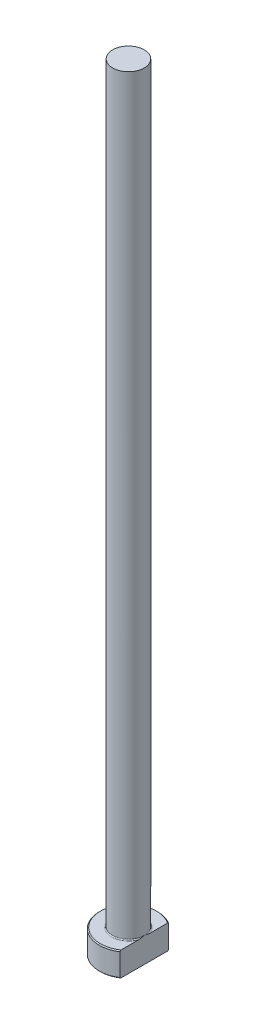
ISO-10303-21;
HEADER;
FILE_DESCRIPTION(('STEP AP214'),'2;1');
FILE_NAME('part.step','',(''),(''),'','','');
FILE_SCHEMA(('AUTOMOTIVE_DESIGN { 1 0 10303 214 1 1 1 1 }'));
ENDSEC;
DATA;
#1=APPLICATION_CONTEXT('core data for automotive mechanical design processes');
#2=APPLICATION_PROTOCOL_DEFINITION('international standard','automotive_design',2000,#1);
#3=PRODUCT_CONTEXT('',#1,'mechanical');
#4=PRODUCT('Part','Part','',(#3));
#5=PRODUCT_RELATED_PRODUCT_CATEGORY('part','',(#4));
#6=PRODUCT_DEFINITION_FORMATION('','',#4);
#7=PRODUCT_DEFINITION_CONTEXT('part definition',#1,'design');
#8=PRODUCT_DEFINITION('design','',#6,#7);
#9=PRODUCT_DEFINITION_SHAPE('','',#8);
#10=(LENGTH_UNIT() NAMED_UNIT(*) SI_UNIT(.MILLI.,.METRE.));
#11=(NAMED_UNIT(*) PLANE_ANGLE_UNIT() SI_UNIT($,.RADIAN.));
#12=(NAMED_UNIT(*) SI_UNIT($,.STERADIAN.) SOLID_ANGLE_UNIT());
#13=UNCERTAINTY_MEASURE_WITH_UNIT(LENGTH_MEASURE(1.E-05),#10,'distance_accuracy_value','');
#14=(GEOMETRIC_REPRESENTATION_CONTEXT(3) GLOBAL_UNCERTAINTY_ASSIGNED_CONTEXT((#13)) GLOBAL_UNIT_ASSIGNED_CONTEXT((#10,
#11,#12)) REPRESENTATION_CONTEXT('',''));
#15=CARTESIAN_POINT('',(0.,0.,0.));
#16=DIRECTION('',(0.,0.,1.));
#17=DIRECTION('',(1.,0.,0.));
#18=AXIS2_PLACEMENT_3D('',#15,#16,#17);
#19=CARTESIAN_POINT('',(0.,0.,0.));
#20=DIRECTION('',(0.,-1.,0.));
#21=DIRECTION('',(0.,0.,-1.));
#22=AXIS2_PLACEMENT_3D('',#19,#20,#21);
#23=PLANE('',#22);
#24=CARTESIAN_POINT('',(0.,0.,0.));
#25=DIRECTION('',(0.,-1.,0.));
#26=DIRECTION('',(0.,0.,-1.));
#27=AXIS2_PLACEMENT_3D('',#24,#25,#26);
#28=CIRCLE('',#27,5.79999999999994);
#29=CARTESIAN_POINT('',(3.24999999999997,0.,4.80390466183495));
#30=VERTEX_POINT('',#29);
#31=CARTESIAN_POINT('',(3.24999999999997,0.,-4.80390466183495));
#32=VERTEX_POINT('',#31);
#33=EDGE_CURVE('E98',#30,#32,#28,.T.);
#34=ORIENTED_EDGE('',*,*,#33,.T.);
#35=DIRECTION('',(0.,0.,1.));
#36=VECTOR('',#35,1.);
#37=CARTESIAN_POINT('',(3.24999999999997,0.,-5.04356025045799));
#38=LINE('',#37,#36);
#39=EDGE_CURVE('E83',#32,#30,#38,.T.);
#40=ORIENTED_EDGE('',*,*,#39,.T.);
#41=EDGE_LOOP('',(#34,#40));
#42=FACE_BOUND('',#41,.T.);
#43=ADVANCED_FACE('F32',(#42),#23,.T.);
#44=CARTESIAN_POINT('',(0.,259.958771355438,0.));
#45=DIRECTION('',(0.,1.,0.));
#46=DIRECTION('',(0.,0.,1.));
#47=AXIS2_PLACEMENT_3D('',#44,#45,#46);
#48=CYLINDRICAL_SURFACE('',#47,5.99999999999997);
#49=CARTESIAN_POINT('',(0.,4.80000000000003,0.));
#50=DIRECTION('',(0.,1.,0.));
#51=DIRECTION('',(0.,0.,1.));
#52=AXIS2_PLACEMENT_3D('',#49,#50,#51);
#53=CIRCLE('',#52,5.99999999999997);
#54=CARTESIAN_POINT('',(3.24999999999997,4.80000000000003,5.04356025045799));
#55=VERTEX_POINT('',#54);
#56=CARTESIAN_POINT('',(3.24999999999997,4.80000000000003,-5.04356025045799));
#57=VERTEX_POINT('',#56);
#58=EDGE_CURVE('E104',#55,#57,#53,.F.);
#59=ORIENTED_EDGE('',*,*,#58,.T.);
#60=DIRECTION('',(0.,-1.,0.));
#61=VECTOR('',#60,1.);
#62=CARTESIAN_POINT('',(3.24999999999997,160.,-5.04356025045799));
#63=LINE('',#62,#61);
#64=CARTESIAN_POINT('',(3.24999999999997,0.200000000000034,-5.04356025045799));
#65=VERTEX_POINT('',#64);
#66=EDGE_CURVE('E183',#57,#65,#63,.T.);
#67=ORIENTED_EDGE('',*,*,#66,.T.);
#68=CARTESIAN_POINT('',(0.,0.200000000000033,0.));
#69=DIRECTION('',(0.,-1.,0.));
#70=DIRECTION('',(0.,0.,-1.));
#71=AXIS2_PLACEMENT_3D('',#68,#69,#70);
#72=CIRCLE('',#71,5.99999999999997);
#73=CARTESIAN_POINT('',(3.24999999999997,0.200000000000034,5.04356025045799));
#74=VERTEX_POINT('',#73);
#75=EDGE_CURVE('E100',#65,#74,#72,.F.);
#76=ORIENTED_EDGE('',*,*,#75,.T.);
#77=DIRECTION('',(0.,-1.,0.));
#78=VECTOR('',#77,1.);
#79=CARTESIAN_POINT('',(3.24999999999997,160.,5.04356025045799));
#80=LINE('',#79,#78);
#81=EDGE_CURVE('E93',#55,#74,#80,.T.);
#82=ORIENTED_EDGE('',*,*,#81,.F.);
#83=EDGE_LOOP('',(#59,#67,#76,#82));
#84=FACE_BOUND('',#83,.T.);
#85=ADVANCED_FACE('F158',(#84),#48,.T.);
#86=CARTESIAN_POINT('',(-5.99999999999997,5.,0.));
#87=DIRECTION('',(0.,1.,0.));
#88=DIRECTION('',(0.,0.,1.));
#89=AXIS2_PLACEMENT_3D('',#86,#87,#88);
#90=PLANE('',#89);
#91=CARTESIAN_POINT('',(0.,5.,0.));
#92=DIRECTION('',(0.,1.,0.));
#93=DIRECTION('',(0.,0.,1.));
#94=AXIS2_PLACEMENT_3D('',#91,#92,#93);
#95=CIRCLE('',#94,5.79999999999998);
#96=CARTESIAN_POINT('',(3.24999999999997,5.,-4.80390466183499));
#97=VERTEX_POINT('',#96);
#98=CARTESIAN_POINT('',(3.24999999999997,5.,4.80390466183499));
#99=VERTEX_POINT('',#98);
#100=EDGE_CURVE('E178',#97,#99,#95,.T.);
#101=ORIENTED_EDGE('',*,*,#100,.T.);
#102=DIRECTION('',(0.,0.,-1.));
#103=VECTOR('',#102,1.);
#104=CARTESIAN_POINT('',(3.24999999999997,5.,0.));
#105=LINE('',#104,#103);
#106=CARTESIAN_POINT('',(3.24999999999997,4.99999999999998,1.15758369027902));
#107=VERTEX_POINT('',#106);
#108=EDGE_CURVE('E57',#99,#107,#105,.T.);
#109=ORIENTED_EDGE('',*,*,#108,.T.);
#110=CARTESIAN_POINT('',(0.,5.,0.));
#111=DIRECTION('',(0.,1.,0.));
#112=DIRECTION('',(0.,0.,1.));
#113=AXIS2_PLACEMENT_3D('',#110,#111,#112);
#114=CIRCLE('',#113,3.44999999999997);
#115=CARTESIAN_POINT('',(3.24999999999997,4.99999999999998,-1.15758369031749));
#116=VERTEX_POINT('',#115);
#117=EDGE_CURVE('E107',#107,#116,#114,.F.);
#118=ORIENTED_EDGE('',*,*,#117,.T.);
#119=EDGE_CURVE('E136',#116,#97,#105,.T.);
#120=ORIENTED_EDGE('',*,*,#119,.T.);
#121=EDGE_LOOP('',(#101,#109,#118,#120));
#122=FACE_BOUND('',#121,.T.);
#123=ADVANCED_FACE('F147',(#122),#90,.T.);
#124=CARTESIAN_POINT('',(0.,5.,0.));
#125=DIRECTION('',(0.,-1.,0.));
#126=DIRECTION('',(0.,0.,-1.));
#127=AXIS2_PLACEMENT_3D('',#124,#125,#126);
#128=CONICAL_SURFACE('',#127,5.79999999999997,0.785398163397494);
#129=ORIENTED_EDGE('',*,*,#58,.F.);
#130=CARTESIAN_POINT('',(3.24999999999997,-0.763340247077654,11.097222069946));
#131=CARTESIAN_POINT('',(3.24999999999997,-0.555249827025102,10.8803821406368));
#132=CARTESIAN_POINT('',(3.24999999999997,-0.347401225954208,10.6633095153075));
#133=CARTESIAN_POINT('',(3.24999999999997,0.0676973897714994,10.2285893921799));
#134=CARTESIAN_POINT('',(3.24999999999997,0.274947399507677,10.010941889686));
#135=CARTESIAN_POINT('',(3.24999999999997,0.68879015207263,9.5749031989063));
#136=CARTESIAN_POINT('',(3.24999999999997,0.895382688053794,9.35651181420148));
#137=CARTESIAN_POINT('',(3.24999999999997,1.30769007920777,8.91890298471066));
#138=CARTESIAN_POINT('',(3.24999999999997,1.51340493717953,8.69968554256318));
#139=CARTESIAN_POINT('',(3.24999999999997,1.92056067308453,8.26365159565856));
#140=CARTESIAN_POINT('',(3.24999999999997,2.1220182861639,8.04685072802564));
#141=CARTESIAN_POINT('',(3.24999999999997,2.52361432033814,7.61203089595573));
#142=CARTESIAN_POINT('',(3.24999999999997,2.72375274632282,7.39401193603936));
#143=CARTESIAN_POINT('',(3.24999999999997,3.1223203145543,6.95646589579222));
#144=CARTESIAN_POINT('',(3.24999999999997,3.32074966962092,6.73693900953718));
#145=CARTESIAN_POINT('',(3.24999999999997,3.71541049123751,6.2959206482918));
#146=CARTESIAN_POINT('',(3.24999999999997,3.91164199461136,6.07442920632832));
#147=CARTESIAN_POINT('',(3.24999999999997,4.26795525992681,5.66684646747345));
#148=CARTESIAN_POINT('',(3.24999999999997,4.42849662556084,5.48115751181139));
#149=CARTESIAN_POINT('',(3.24999999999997,4.74694681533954,5.10749706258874));
#150=CARTESIAN_POINT('',(3.24999999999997,4.9048553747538,4.91952534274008));
#151=CARTESIAN_POINT('',(3.24999999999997,5.21865243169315,4.53879767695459));
#152=CARTESIAN_POINT('',(3.24999999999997,5.37450606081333,4.34601291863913));
#153=CARTESIAN_POINT('',(3.24999999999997,5.68118935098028,3.95653844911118));
#154=CARTESIAN_POINT('',(3.24999999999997,5.83202036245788,3.75984981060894));
#155=CARTESIAN_POINT('',(3.24999999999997,6.05390638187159,3.4594085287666));
#156=CARTESIAN_POINT('',(3.24999999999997,6.12763821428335,3.35763377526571));
#157=CARTESIAN_POINT('',(3.24999999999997,6.27282302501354,3.15247478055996));
#158=CARTESIAN_POINT('',(3.24999999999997,6.3442761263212,3.04909062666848));
#159=CARTESIAN_POINT('',(3.24999999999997,6.48448981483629,2.84026816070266));
#160=CARTESIAN_POINT('',(3.24999999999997,6.55324599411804,2.7348268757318));
#161=CARTESIAN_POINT('',(3.24999999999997,6.68723865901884,2.52174014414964));
#162=CARTESIAN_POINT('',(3.24999999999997,6.75247550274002,2.4140949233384));
#163=CARTESIAN_POINT('',(3.24999999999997,6.87780644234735,2.19745654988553));
#164=CARTESIAN_POINT('',(3.24999999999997,6.93795082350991,2.08849289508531));
#165=CARTESIAN_POINT('',(3.24999999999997,7.05273719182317,1.86772106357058));
#166=CARTESIAN_POINT('',(3.24999999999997,7.10737807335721,1.75591232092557));
#167=CARTESIAN_POINT('',(3.24999999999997,7.26056715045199,1.41626442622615));
#168=CARTESIAN_POINT('',(3.24999999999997,7.34888232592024,1.1833811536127));
#169=CARTESIAN_POINT('',(3.24999999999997,7.44593218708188,0.835575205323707));
#170=CARTESIAN_POINT('',(3.24999999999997,7.4718222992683,0.725406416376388));
#171=CARTESIAN_POINT('',(3.24999999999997,7.51310579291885,0.5030789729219));
#172=CARTESIAN_POINT('',(3.24999999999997,7.52850034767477,0.390920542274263));
#173=CARTESIAN_POINT('',(3.24999999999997,7.54767882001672,0.166070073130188));
#174=CARTESIAN_POINT('',(3.24999999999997,7.5515109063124,0.0533822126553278));
#175=CARTESIAN_POINT('',(3.24999999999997,7.54741082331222,-0.171782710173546));
#176=CARTESIAN_POINT('',(3.24999999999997,7.5394779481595,-0.28425975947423));
#177=CARTESIAN_POINT('',(3.24999999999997,7.51253523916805,-0.507025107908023));
#178=CARTESIAN_POINT('',(3.24999999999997,7.4936058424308,-0.617323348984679));
#179=CARTESIAN_POINT('',(3.24999999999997,7.44595440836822,-0.835762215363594));
#180=CARTESIAN_POINT('',(3.24999999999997,7.41723093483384,-0.943902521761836));
#181=CARTESIAN_POINT('',(3.24999999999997,7.35127840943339,-1.15830231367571));
#182=CARTESIAN_POINT('',(3.24999999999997,7.31399439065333,-1.26454464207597));
#183=CARTESIAN_POINT('',(3.24999999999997,7.23254630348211,-1.47430332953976));
#184=CARTESIAN_POINT('',(3.24999999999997,7.18838353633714,-1.57782019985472));
#185=CARTESIAN_POINT('',(3.24999999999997,7.09672451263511,-1.7774238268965));
#186=CARTESIAN_POINT('',(3.24999999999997,7.04948595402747,-1.87363004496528));
#187=CARTESIAN_POINT('',(3.24999999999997,6.95089019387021,-2.06391775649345));
#188=CARTESIAN_POINT('',(3.24999999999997,6.89953216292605,-2.15799881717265));
#189=CARTESIAN_POINT('',(3.24999999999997,6.74036914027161,-2.43755985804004));
#190=CARTESIAN_POINT('',(3.24999999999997,6.62755752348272,-2.62018561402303));
#191=CARTESIAN_POINT('',(3.24999999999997,6.39256809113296,-2.98019331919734));
#192=CARTESIAN_POINT('',(3.24999999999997,6.27035601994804,-3.15755247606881));
#193=CARTESIAN_POINT('',(3.24999999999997,6.0197011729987,-3.50765833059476));
#194=CARTESIAN_POINT('',(3.24999999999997,5.8912614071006,-3.68040719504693));
#195=CARTESIAN_POINT('',(3.24999999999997,5.62829316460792,-4.02448614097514));
#196=CARTESIAN_POINT('',(3.24999999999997,5.49371006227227,-4.19577421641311));
#197=CARTESIAN_POINT('',(3.24999999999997,5.22110967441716,-4.5356145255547));
#198=CARTESIAN_POINT('',(3.24999999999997,5.08309204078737,-4.70416647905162));
#199=CARTESIAN_POINT('',(3.24999999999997,4.80478673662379,-5.03871726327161));
#200=CARTESIAN_POINT('',(3.24999999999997,4.66450509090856,-5.20472111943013));
#201=CARTESIAN_POINT('',(3.24999999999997,4.38193422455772,-5.53501285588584));
#202=CARTESIAN_POINT('',(3.24999999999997,4.23964496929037,-5.69930070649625));
#203=CARTESIAN_POINT('',(3.24999999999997,3.89726045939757,-6.09077577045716));
#204=CARTESIAN_POINT('',(3.24999999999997,3.69642117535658,-6.31731165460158));
#205=CARTESIAN_POINT('',(3.24999999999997,3.29246897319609,-6.76834962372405));
#206=CARTESIAN_POINT('',(3.24999999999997,3.08935601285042,-6.99285167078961));
#207=CARTESIAN_POINT('',(3.24999999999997,2.68122553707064,-7.44046009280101));
#208=CARTESIAN_POINT('',(3.24999999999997,2.47620657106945,-7.66356514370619));
#209=CARTESIAN_POINT('',(3.24999999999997,2.06481442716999,-8.10852300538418));
#210=CARTESIAN_POINT('',(3.24999999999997,1.85844124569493,-8.33037581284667));
#211=CARTESIAN_POINT('',(3.24999999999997,1.45176082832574,-8.76543407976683));
#212=CARTESIAN_POINT('',(3.24999999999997,1.25149010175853,-8.9786736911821));
#213=CARTESIAN_POINT('',(3.24999999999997,0.850131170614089,-9.40438299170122));
#214=CARTESIAN_POINT('',(3.24999999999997,0.649042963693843,-9.61685267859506));
#215=CARTESIAN_POINT('',(3.24999999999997,0.246391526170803,-10.0409455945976));
#216=CARTESIAN_POINT('',(3.24999999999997,0.0448289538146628,-10.2525694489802));
#217=CARTESIAN_POINT('',(3.24999999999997,-0.358859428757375,-10.6752763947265));
#218=CARTESIAN_POINT('',(3.24999999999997,-0.560985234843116,-10.8863594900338));
#219=CARTESIAN_POINT('',(3.24999999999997,-0.763340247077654,-11.097222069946));
#220=B_SPLINE_CURVE_WITH_KNOTS('',3,(#130,#131,#132,#133,#134,#135,#136,#137,#138,#139,#140,
#141,#142,#143,#144,#145,#146,#147,#148,#149,#150,#151,#152,#153,#154,#155,#156,#157,#158,#159,
#160,#161,#162,#163,#164,#165,#166,#167,#168,#169,#170,#171,#172,#173,#174,#175,#176,#177,#178,
#179,#180,#181,#182,#183,#184,#185,#186,#187,#188,#189,#190,#191,#192,#193,#194,#195,#196,#197,
#198,#199,#200,#201,#202,#203,#204,#205,#206,#207,#208,#209,#210,#211,#212,#213,#214,#215,#216,
#217,#218,#219),.UNSPECIFIED.,.F.,.F.,(4,2,2,2,2,2,2,2,2,2,2,2,2,2,2,2,2,2,2,2,2,2,2,2,2,2,2,2,
2,2,2,2,2,2,2,2,2,2,2,2,2,2,2,2,4),(0.,0.901604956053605,1.80321729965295,2.70508973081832,
3.60695928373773,4.49481204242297,5.3826615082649,6.27039876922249,7.15812113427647,
7.89450333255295,8.63095913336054,9.37461869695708,10.1180766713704,10.4950808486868,
10.8720646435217,11.2496408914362,11.6271786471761,12.0003984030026,12.3736929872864,
13.117405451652,13.4565058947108,13.795568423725,14.1332164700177,14.4708847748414,
14.8061136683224,15.1413917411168,15.4788860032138,15.8163164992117,16.1377318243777,
16.4592120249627,17.1027431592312,17.7487418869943,18.3944314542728,19.0478814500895,
19.7013979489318,20.3533948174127,21.0054029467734,21.9136176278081,22.8218492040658,
23.7308402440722,24.6398336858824,25.5174503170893,26.3950694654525,27.2718289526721,
28.1485820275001),.UNSPECIFIED.);
#221=EDGE_CURVE('E135',#55,#99,#220,.T.);
#222=ORIENTED_EDGE('',*,*,#221,.T.);
#223=ORIENTED_EDGE('',*,*,#100,.F.);
#224=EDGE_CURVE('E127',#97,#57,#220,.T.);
#225=ORIENTED_EDGE('',*,*,#224,.T.);
#226=EDGE_LOOP('',(#129,#222,#223,#225));
#227=FACE_BOUND('',#226,.T.);
#228=ADVANCED_FACE('F143',(#227),#128,.T.);
#229=CARTESIAN_POINT('',(0.,0.200000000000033,0.));
#230=DIRECTION('',(0.,1.,0.));
#231=DIRECTION('',(0.,0.,1.));
#232=AXIS2_PLACEMENT_3D('',#229,#230,#231);
#233=CONICAL_SURFACE('',#232,5.99999999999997,0.785398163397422);
#234=ORIENTED_EDGE('',*,*,#75,.F.);
#235=CARTESIAN_POINT('',(3.24999999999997,5.76334024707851,-11.0972220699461));
#236=CARTESIAN_POINT('',(3.24999999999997,5.55524982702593,-10.8803821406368));
#237=CARTESIAN_POINT('',(3.24999999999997,5.347401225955,-10.6633095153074));
#238=CARTESIAN_POINT('',(3.24999999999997,4.93230261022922,-10.2285893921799));
#239=CARTESIAN_POINT('',(3.24999999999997,4.72505260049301,-10.0109418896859));
#240=CARTESIAN_POINT('',(3.24999999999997,4.31120984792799,-9.57490319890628));
#241=CARTESIAN_POINT('',(3.24999999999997,4.10461731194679,-9.35651181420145));
#242=CARTESIAN_POINT('',(3.24999999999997,3.69230992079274,-8.91890298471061));
#243=CARTESIAN_POINT('',(3.24999999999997,3.48659506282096,-8.69968554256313));
#244=CARTESIAN_POINT('',(3.24999999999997,3.07943932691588,-8.26365159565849));
#245=CARTESIAN_POINT('',(3.24999999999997,2.87798171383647,-8.04685072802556));
#246=CARTESIAN_POINT('',(3.24999999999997,2.47638567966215,-7.61203089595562));
#247=CARTESIAN_POINT('',(3.24999999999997,2.27624725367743,-7.39401193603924));
#248=CARTESIAN_POINT('',(3.24999999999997,1.87767968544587,-6.95646589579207));
#249=CARTESIAN_POINT('',(3.24999999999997,1.6792503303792,-6.73693900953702));
#250=CARTESIAN_POINT('',(3.24999999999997,1.28458950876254,-6.29592064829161));
#251=CARTESIAN_POINT('',(3.24999999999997,1.08835800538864,-6.07442920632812));
#252=CARTESIAN_POINT('',(3.24999999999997,0.732044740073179,-5.66684646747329));
#253=CARTESIAN_POINT('',(3.24999999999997,0.57150337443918,-5.48115751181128));
#254=CARTESIAN_POINT('',(3.24999999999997,0.253053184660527,-5.10749706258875));
#255=CARTESIAN_POINT('',(3.24999999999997,0.0951446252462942,-4.91952534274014));
#256=CARTESIAN_POINT('',(3.24999999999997,-0.218652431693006,-4.53879767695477));
#257=CARTESIAN_POINT('',(3.24999999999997,-0.374506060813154,-4.34601291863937));
#258=CARTESIAN_POINT('',(3.24999999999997,-0.681189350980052,-3.95653844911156));
#259=CARTESIAN_POINT('',(3.24999999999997,-0.832020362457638,-3.75984981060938));
#260=CARTESIAN_POINT('',(3.24999999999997,-1.05390638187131,-3.45940852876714));
#261=CARTESIAN_POINT('',(3.24999999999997,-1.12763821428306,-3.35763377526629));
#262=CARTESIAN_POINT('',(3.24999999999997,-1.27282302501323,-3.15247478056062));
#263=CARTESIAN_POINT('',(3.24999999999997,-1.34427612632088,-3.04909062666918));
#264=CARTESIAN_POINT('',(3.24999999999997,-1.48448981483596,-2.84026816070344));
#265=CARTESIAN_POINT('',(3.24999999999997,-1.5532459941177,-2.73482687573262));
#266=CARTESIAN_POINT('',(3.24999999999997,-1.6872386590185,-2.52174014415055));
#267=CARTESIAN_POINT('',(3.24999999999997,-1.75247550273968,-2.41409492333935));
#268=CARTESIAN_POINT('',(3.24999999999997,-1.87780644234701,-2.19745654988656));
#269=CARTESIAN_POINT('',(3.24999999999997,-1.93795082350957,-2.08849289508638));
#270=CARTESIAN_POINT('',(3.24999999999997,-2.05273719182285,-1.86772106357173));
#271=CARTESIAN_POINT('',(3.24999999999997,-2.10737807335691,-1.75591232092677));
#272=CARTESIAN_POINT('',(3.24999999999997,-2.26056715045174,-1.41626442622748));
#273=CARTESIAN_POINT('',(3.24999999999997,-2.34888232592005,-1.18338115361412));
#274=CARTESIAN_POINT('',(3.24999999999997,-2.44593218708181,-0.835575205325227));
#275=CARTESIAN_POINT('',(3.24999999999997,-2.47182229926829,-0.725406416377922));
#276=CARTESIAN_POINT('',(3.24999999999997,-2.51310579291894,-0.50307897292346));
#277=CARTESIAN_POINT('',(3.24999999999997,-2.52850034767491,-0.390920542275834));
#278=CARTESIAN_POINT('',(3.24999999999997,-2.54767882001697,-0.166070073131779));
#279=CARTESIAN_POINT('',(3.24999999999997,-2.5515109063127,-0.0533822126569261));
#280=CARTESIAN_POINT('',(3.24999999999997,-2.54741082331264,0.171782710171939));
#281=CARTESIAN_POINT('',(3.24999999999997,-2.53947794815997,0.284259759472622));
#282=CARTESIAN_POINT('',(3.24999999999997,-2.51253523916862,0.507025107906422));
#283=CARTESIAN_POINT('',(3.24999999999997,-2.49360584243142,0.617323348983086));
#284=CARTESIAN_POINT('',(3.24999999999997,-2.44595440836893,0.835762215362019));
#285=CARTESIAN_POINT('',(3.24999999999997,-2.41723093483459,0.943902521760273));
#286=CARTESIAN_POINT('',(3.24999999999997,-2.35127840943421,1.15830231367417));
#287=CARTESIAN_POINT('',(3.24999999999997,-2.31399439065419,1.26454464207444));
#288=CARTESIAN_POINT('',(3.24999999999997,-2.23254630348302,1.47430332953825));
#289=CARTESIAN_POINT('',(3.24999999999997,-2.18838353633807,1.57782019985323));
#290=CARTESIAN_POINT('',(3.24999999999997,-2.09672451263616,1.77742382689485));
#291=CARTESIAN_POINT('',(3.24999999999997,-2.04948595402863,1.87363004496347));
#292=CARTESIAN_POINT('',(3.24999999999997,-1.95089019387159,2.06391775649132));
#293=CARTESIAN_POINT('',(3.24999999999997,-1.89953216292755,2.15799881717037));
#294=CARTESIAN_POINT('',(3.24999999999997,-1.74036914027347,2.4375598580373));
#295=CARTESIAN_POINT('',(3.24999999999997,-1.62755752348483,2.62018561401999));
#296=CARTESIAN_POINT('',(3.24999999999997,-1.39256809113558,2.98019331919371));
#297=CARTESIAN_POINT('',(3.24999999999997,-1.27035601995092,3.15755247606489));
#298=CARTESIAN_POINT('',(3.24999999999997,-1.01970117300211,3.50765833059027));
#299=CARTESIAN_POINT('',(3.24999999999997,-0.891261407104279,3.68040719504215));
#300=CARTESIAN_POINT('',(3.24999999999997,-0.628293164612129,4.0244861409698));
#301=CARTESIAN_POINT('',(3.24999999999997,-0.493710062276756,4.19577421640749));
#302=CARTESIAN_POINT('',(3.24999999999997,-0.221109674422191,4.53561452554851));
#303=CARTESIAN_POINT('',(3.24999999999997,-0.0830920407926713,4.70416647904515));
#304=CARTESIAN_POINT('',(3.24999999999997,0.19521326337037,5.03871726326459));
#305=CARTESIAN_POINT('',(3.24999999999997,0.335494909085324,5.20472111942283));
#306=CARTESIAN_POINT('',(3.24999999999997,0.618065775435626,5.53501285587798));
#307=CARTESIAN_POINT('',(3.24999999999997,0.7603550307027,5.69930070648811));
#308=CARTESIAN_POINT('',(3.24999999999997,1.10273954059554,6.09077577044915));
#309=CARTESIAN_POINT('',(3.24999999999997,1.30357882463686,6.31731165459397));
#310=CARTESIAN_POINT('',(3.24999999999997,1.70753102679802,6.76834962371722));
#311=CARTESIAN_POINT('',(3.24999999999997,1.91064398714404,6.99285167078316));
#312=CARTESIAN_POINT('',(3.24999999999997,2.31877446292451,7.44046009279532));
#313=CARTESIAN_POINT('',(3.24999999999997,2.52379342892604,7.66356514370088));
#314=CARTESIAN_POINT('',(3.24999999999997,2.93518557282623,8.10852300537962));
#315=CARTESIAN_POINT('',(3.24999999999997,3.14155875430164,8.33037581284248));
#316=CARTESIAN_POINT('',(3.24999999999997,3.54823917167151,8.76543407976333));
#317=CARTESIAN_POINT('',(3.24999999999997,3.74850989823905,8.97867369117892));
#318=CARTESIAN_POINT('',(3.24999999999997,4.14986882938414,9.40438299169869));
#319=CARTESIAN_POINT('',(3.24999999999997,4.35095703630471,9.61685267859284));
#320=CARTESIAN_POINT('',(3.24999999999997,4.75360847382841,10.040945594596));
#321=CARTESIAN_POINT('',(3.24999999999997,4.95517104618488,10.252569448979));
#322=CARTESIAN_POINT('',(3.24999999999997,5.35885942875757,10.6752763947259));
#323=CARTESIAN_POINT('',(3.24999999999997,5.56098523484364,10.8863594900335));
#324=CARTESIAN_POINT('',(3.24999999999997,5.76334024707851,11.097222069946));
#325=B_SPLINE_CURVE_WITH_KNOTS('',3,(#235,#236,#237,#238,#239,#240,#241,#242,#243,#244,#245,
#246,#247,#248,#249,#250,#251,#252,#253,#254,#255,#256,#257,#258,#259,#260,#261,#262,#263,#264,
#265,#266,#267,#268,#269,#270,#271,#272,#273,#274,#275,#276,#277,#278,#279,#280,#281,#282,#283,
#284,#285,#286,#287,#288,#289,#290,#291,#292,#293,#294,#295,#296,#297,#298,#299,#300,#301,#302,
#303,#304,#305,#306,#307,#308,#309,#310,#311,#312,#313,#314,#315,#316,#317,#318,#319,#320,#321,
#322,#323,#324),.UNSPECIFIED.,.F.,.F.,(4,2,2,2,2,2,2,2,2,2,2,2,2,2,2,2,2,2,2,2,2,2,2,2,2,2,2,2,
2,2,2,2,2,2,2,2,2,2,2,2,2,2,2,2,4),(0.,0.901604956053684,1.80321729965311,2.70508973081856,
3.60695928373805,4.4948120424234,5.38266150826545,6.27039876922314,7.15812113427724,
7.89450333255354,8.63095913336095,9.3746186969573,10.1180766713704,10.4950808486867,
10.8720646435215,11.2496408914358,11.6271786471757,12.000398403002,12.3736929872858,
13.1174054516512,13.4565058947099,13.7955684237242,14.1332164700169,14.4708847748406,
14.8061136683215,15.1413917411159,15.478886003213,15.8163164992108,16.1377318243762,
16.4592120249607,17.1027431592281,17.74874188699,18.3944314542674,19.0478814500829,
19.701397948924,20.3533948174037,21.0054029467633,21.9136176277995,22.8218492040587,
23.7308402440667,24.6398336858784,25.5174503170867,26.3950694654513,27.2718289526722,
28.1485820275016),.UNSPECIFIED.);
#326=EDGE_CURVE('E86',#65,#32,#325,.T.);
#327=ORIENTED_EDGE('',*,*,#326,.T.);
#328=ORIENTED_EDGE('',*,*,#33,.F.);
#329=EDGE_CURVE('E89',#30,#74,#325,.T.);
#330=ORIENTED_EDGE('',*,*,#329,.T.);
#331=EDGE_LOOP('',(#234,#327,#328,#330));
#332=FACE_BOUND('',#331,.T.);
#333=ADVANCED_FACE('F97',(#332),#233,.T.);
#334=CARTESIAN_POINT('',(0.,5.19999999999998,0.));
#335=DIRECTION('',(0.,1.,0.));
#336=DIRECTION('',(0.,0.,1.));
#337=AXIS2_PLACEMENT_3D('',#334,#335,#336);
#338=TOROIDAL_SURFACE('',#337,3.44999999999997,0.2);
#339=CARTESIAN_POINT('',(3.24999999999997,5.19999999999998,0.));
#340=CARTESIAN_POINT('',(3.24999999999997,5.20000050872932,1.30593484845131E-10));
#341=CARTESIAN_POINT('',(3.24999999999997,5.20000101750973,-2.02989018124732E-07));
#342=CARTESIAN_POINT('',(3.24999999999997,5.20000196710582,-7.62846146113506E-07));
#343=CARTESIAN_POINT('',(3.24999999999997,5.20000239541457,-1.13332165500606E-06));
#344=CARTESIAN_POINT('',(3.24999999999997,5.20000328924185,-2.02149564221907E-06));
#345=CARTESIAN_POINT('',(3.24999999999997,5.20000374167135,-2.55359112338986E-06));
#346=CARTESIAN_POINT('',(3.24999999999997,5.20000454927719,-3.65434903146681E-06));
#347=CARTESIAN_POINT('',(3.24999999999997,5.20000490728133,-4.22110424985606E-06));
#348=CARTESIAN_POINT('',(3.24999999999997,5.20000624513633,-6.42540895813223E-06));
#349=CARTESIAN_POINT('',(3.24999999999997,5.20000715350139,-8.1091236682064E-06));
#350=CARTESIAN_POINT('',(3.24999999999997,5.20000863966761,-1.14364149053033E-05));
#351=CARTESIAN_POINT('',(3.24999999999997,5.20000923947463,-1.30705587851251E-05));
#352=CARTESIAN_POINT('',(3.24999999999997,5.20001177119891,-2.00139280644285E-05));
#353=CARTESIAN_POINT('',(3.24999999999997,5.20001367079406,-2.53379428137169E-05));
#354=CARTESIAN_POINT('',(3.24999999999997,5.20001645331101,-3.53765138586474E-05));
#355=CARTESIAN_POINT('',(3.24999999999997,5.20001744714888,-4.00600779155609E-05));
#356=CARTESIAN_POINT('',(3.24999999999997,5.20002471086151,-7.49504389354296E-05));
#357=CARTESIAN_POINT('',(3.24999999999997,5.20003024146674,-0.00010526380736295));
#358=CARTESIAN_POINT('',(3.24999999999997,5.20005445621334,-0.00022532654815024));
#359=CARTESIAN_POINT('',(3.24999999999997,5.20007753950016,-0.000314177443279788));
#360=CARTESIAN_POINT('',(3.24999999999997,5.20016768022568,-0.000666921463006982));
#361=CARTESIAN_POINT('',(3.24999999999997,5.20023191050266,-0.000931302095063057));
#362=CARTESIAN_POINT('',(3.24999999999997,5.20048969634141,-0.00198463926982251));
#363=CARTESIAN_POINT('',(3.24999999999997,5.20068683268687,-0.0027729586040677));
#364=CARTESIAN_POINT('',(3.24999999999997,5.20150726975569,-0.00606245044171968));
#365=CARTESIAN_POINT('',(3.24999999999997,5.20212605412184,-0.00856442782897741));
#366=CARTESIAN_POINT('',(3.24999999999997,5.20719838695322,-0.0290628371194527));
#367=CARTESIAN_POINT('',(3.24999999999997,5.21166800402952,-0.0470565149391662));
#368=CARTESIAN_POINT('',(3.24999999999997,5.22040162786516,-0.0823313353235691));
#369=CARTESIAN_POINT('',(3.24999999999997,5.22466671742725,-0.0996122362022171));
#370=CARTESIAN_POINT('',(3.24999999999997,5.23855308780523,-0.156076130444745));
#371=CARTESIAN_POINT('',(3.24999999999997,5.24811538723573,-0.195273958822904));
#372=CARTESIAN_POINT('',(3.24999999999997,5.26421029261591,-0.262424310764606));
#373=CARTESIAN_POINT('',(3.24999999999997,5.27082096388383,-0.290358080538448));
#374=CARTESIAN_POINT('',(3.24999999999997,5.28365202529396,-0.345539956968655));
#375=CARTESIAN_POINT('',(3.24999999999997,5.28987810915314,-0.3727867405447));
#376=CARTESIAN_POINT('',(3.24999999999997,5.30721519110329,-0.45039737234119));
#377=CARTESIAN_POINT('',(3.24999999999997,5.31800675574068,-0.500833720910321));
#378=CARTESIAN_POINT('',(3.24999999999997,5.33836987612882,-0.60242326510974));
#379=CARTESIAN_POINT('',(3.24999999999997,5.34792968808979,-0.653578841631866));
#380=CARTESIAN_POINT('',(3.24999999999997,5.36597954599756,-0.760718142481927));
#381=CARTESIAN_POINT('',(3.24999999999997,5.37430170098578,-0.81673101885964));
#382=CARTESIAN_POINT('',(3.24999999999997,5.38793579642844,-0.928977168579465));
#383=CARTESIAN_POINT('',(3.24999999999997,5.39325594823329,-0.985209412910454));
#384=CARTESIAN_POINT('',(3.24999999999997,5.39967715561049,-1.09627192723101));
#385=CARTESIAN_POINT('',(3.24999999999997,5.40090002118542,-1.15109363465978));
#386=CARTESIAN_POINT('',(3.24999999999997,5.39854105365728,-1.23278196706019));
#387=CARTESIAN_POINT('',(3.24999999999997,5.397083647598,-1.25970835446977));
#388=CARTESIAN_POINT('',(3.24999999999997,5.39248016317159,-1.31340846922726));
#389=CARTESIAN_POINT('',(3.24999999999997,5.38933527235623,-1.34018229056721));
#390=CARTESIAN_POINT('',(3.24999999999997,5.38085808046,-1.39365539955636));
#391=CARTESIAN_POINT('',(3.24999999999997,5.37550486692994,-1.42035144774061));
#392=CARTESIAN_POINT('',(3.24999999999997,5.36186683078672,-1.47304562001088));
#393=CARTESIAN_POINT('',(3.24999999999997,5.35358306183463,-1.49904399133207));
#394=CARTESIAN_POINT('',(3.24999999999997,5.33840624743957,-1.53566403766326));
#395=CARTESIAN_POINT('',(3.24999999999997,5.33319528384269,-1.54697847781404));
#396=CARTESIAN_POINT('',(3.24999999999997,5.32165705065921,-1.56904809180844));
#397=CARTESIAN_POINT('',(3.24999999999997,5.31532920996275,-1.57980297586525));
#398=CARTESIAN_POINT('',(3.24999999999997,5.30232638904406,-1.5988624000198));
#399=CARTESIAN_POINT('',(3.24999999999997,5.2958406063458,-1.60729427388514));
#400=CARTESIAN_POINT('',(3.24999999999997,5.28165581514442,-1.62307272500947));
#401=CARTESIAN_POINT('',(3.24999999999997,5.2739607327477,-1.63042267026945));
#402=CARTESIAN_POINT('',(3.24999999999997,5.26066720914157,-1.64067803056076));
#403=CARTESIAN_POINT('',(3.24999999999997,5.25551950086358,-1.64416379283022));
#404=CARTESIAN_POINT('',(3.24999999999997,5.24475577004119,-1.65032852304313));
#405=CARTESIAN_POINT('',(3.24999999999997,5.23914006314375,-1.65300802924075));
#406=CARTESIAN_POINT('',(3.24999999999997,5.22744494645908,-1.65736207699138));
#407=CARTESIAN_POINT('',(3.24999999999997,5.22136079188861,-1.65902420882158));
#408=CARTESIAN_POINT('',(3.24999999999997,5.20898349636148,-1.66109219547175));
#409=CARTESIAN_POINT('',(3.24999999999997,5.20269065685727,-1.66149978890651));
#410=CARTESIAN_POINT('',(3.24999999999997,5.19107570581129,-1.66104520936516));
#411=CARTESIAN_POINT('',(3.24999999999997,5.18574582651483,-1.66035949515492));
#412=CARTESIAN_POINT('',(3.24999999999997,5.17527668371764,-1.65810570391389));
#413=CARTESIAN_POINT('',(3.24999999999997,5.1701375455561,-1.65653705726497));
#414=CARTESIAN_POINT('',(3.24999999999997,5.15872192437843,-1.65208432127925));
#415=CARTESIAN_POINT('',(3.24999999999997,5.15254320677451,-1.64895170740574));
#416=CARTESIAN_POINT('',(3.24999999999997,5.14076776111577,-1.64173915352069));
#417=CARTESIAN_POINT('',(3.24999999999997,5.13517231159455,-1.63765719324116));
#418=CARTESIAN_POINT('',(3.24999999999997,5.12145239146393,-1.62621801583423));
#419=CARTESIAN_POINT('',(3.24999999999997,5.11376432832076,-1.61834208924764));
#420=CARTESIAN_POINT('',(3.24999999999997,5.09963913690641,-1.6015591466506));
#421=CARTESIAN_POINT('',(3.24999999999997,5.0932043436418,-1.59265025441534));
#422=CARTESIAN_POINT('',(3.24999999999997,5.07579513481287,-1.56554611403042));
#423=CARTESIAN_POINT('',(3.24999999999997,5.06621235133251,-1.54646705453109));
#424=CARTESIAN_POINT('',(3.24999999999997,5.04964498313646,-1.5071324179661));
#425=CARTESIAN_POINT('',(3.24999999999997,5.04268052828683,-1.48686905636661));
#426=CARTESIAN_POINT('',(3.24999999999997,5.02812767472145,-1.43684519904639));
#427=CARTESIAN_POINT('',(3.24999999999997,5.02158372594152,-1.40678481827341));
#428=CARTESIAN_POINT('',(3.24999999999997,5.01134780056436,-1.3461374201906));
#429=CARTESIAN_POINT('',(3.24999999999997,5.00766434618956,-1.31554910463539));
#430=CARTESIAN_POINT('',(3.24999999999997,5.00256038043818,-1.2550900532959));
#431=CARTESIAN_POINT('',(3.24999999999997,5.00107707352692,-1.22522437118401));
#432=CARTESIAN_POINT('',(3.24999999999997,4.99975288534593,-1.16560651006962));
#433=CARTESIAN_POINT('',(3.24999999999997,4.99990422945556,-1.13585446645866));
#434=CARTESIAN_POINT('',(3.24999999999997,5.00180470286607,-1.06636643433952));
#435=CARTESIAN_POINT('',(3.24999999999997,5.00407520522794,-1.02664548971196));
#436=CARTESIAN_POINT('',(3.24999999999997,5.01046283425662,-0.947373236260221));
#437=CARTESIAN_POINT('',(3.24999999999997,5.01457941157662,-0.907821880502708));
#438=CARTESIAN_POINT('',(3.24999999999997,5.02439538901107,-0.827971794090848));
#439=CARTESIAN_POINT('',(3.24999999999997,5.03012984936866,-0.787677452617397));
#440=CARTESIAN_POINT('',(3.24999999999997,5.0428354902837,-0.707180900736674));
#441=CARTESIAN_POINT('',(3.24999999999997,5.04980982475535,-0.666979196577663));
#442=CARTESIAN_POINT('',(3.24999999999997,5.06745383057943,-0.572058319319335));
#443=CARTESIAN_POINT('',(3.24999999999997,5.07854113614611,-0.517417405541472));
#444=CARTESIAN_POINT('',(3.24999999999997,5.10182947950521,-0.409021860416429));
#445=CARTESIAN_POINT('',(3.24999999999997,5.11401657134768,-0.355264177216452));
#446=CARTESIAN_POINT('',(3.24999999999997,5.13769793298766,-0.254099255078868));
#447=CARTESIAN_POINT('',(3.24999999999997,5.14911069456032,-0.206672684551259));
#448=CARTESIAN_POINT('',(3.24999999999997,5.1727713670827,-0.109852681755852));
#449=CARTESIAN_POINT('',(3.24999999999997,5.18503405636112,-0.0604628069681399));
#450=CARTESIAN_POINT('',(3.24999999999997,5.19787537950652,-0.0085581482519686));
#451=CARTESIAN_POINT('',(3.24999999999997,5.19849580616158,-0.00604992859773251));
#452=CARTESIAN_POINT('',(3.24999999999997,5.19931662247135,-0.00275902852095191));
#453=CARTESIAN_POINT('',(3.24999999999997,5.19951254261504,-0.00197555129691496));
#454=CARTESIAN_POINT('',(3.24999999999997,5.1997688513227,-0.000928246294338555));
#455=CARTESIAN_POINT('',(3.24999999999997,5.19983279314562,-0.000665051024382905));
#456=CARTESIAN_POINT('',(3.24999999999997,5.19992258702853,-0.000313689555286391));
#457=CARTESIAN_POINT('',(3.24999999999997,5.19994562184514,-0.000225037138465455));
#458=CARTESIAN_POINT('',(3.24999999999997,5.19996979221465,-0.000105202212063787));
#459=CARTESIAN_POINT('',(3.24999999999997,5.19997531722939,-7.49162835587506E-05));
#460=CARTESIAN_POINT('',(3.24999999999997,5.19998256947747,-4.0053976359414E-05));
#461=CARTESIAN_POINT('',(3.24999999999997,5.1999835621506,-3.53718998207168E-05));
#462=CARTESIAN_POINT('',(3.24999999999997,5.19998634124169,-2.53364128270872E-05));
#463=CARTESIAN_POINT('',(3.24999999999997,5.19998823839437,-2.00139156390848E-05));
#464=CARTESIAN_POINT('',(3.24999999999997,5.19999076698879,-1.30721306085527E-05));
#465=CARTESIAN_POINT('',(3.24999999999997,5.19999136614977,-1.14380977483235E-05));
#466=CARTESIAN_POINT('',(3.24999999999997,5.19999285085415,-8.11092555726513E-06));
#467=CARTESIAN_POINT('',(3.24999999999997,5.19999375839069,-6.42720440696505E-06));
#468=CARTESIAN_POINT('',(3.24999999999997,5.19999509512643,-4.2227718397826E-06));
#469=CARTESIAN_POINT('',(3.24999999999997,5.1999954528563,-3.65594799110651E-06));
#470=CARTESIAN_POINT('',(3.24999999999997,5.19999625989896,-2.55500330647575E-06));
#471=CARTESIAN_POINT('',(3.24999999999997,5.19999671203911,-2.0227876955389E-06));
#472=CARTESIAN_POINT('',(3.24999999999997,5.19999760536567,-1.13433308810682E-06));
#473=CARTESIAN_POINT('',(3.24999999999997,5.19999803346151,-7.63708107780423E-07));
#474=CARTESIAN_POINT('',(3.24999999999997,5.19999898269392,-2.03470796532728E-07));
#475=CARTESIAN_POINT('',(3.24999999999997,5.19999949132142,-1.30580450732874E-10));
#476=CARTESIAN_POINT('',(3.24999999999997,5.19999999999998,0.));
#477=B_SPLINE_CURVE_WITH_KNOTS('',3,(#339,#340,#341,#342,#343,#344,#345,#346,#347,#348,#349,
#350,#351,#352,#353,#354,#355,#356,#357,#358,#359,#360,#361,#362,#363,#364,#365,#366,#367,#368,
#369,#370,#371,#372,#373,#374,#375,#376,#377,#378,#379,#380,#381,#382,#383,#384,#385,#386,#387,
#388,#389,#390,#391,#392,#393,#394,#395,#396,#397,#398,#399,#400,#401,#402,#403,#404,#405,#406,
#407,#408,#409,#410,#411,#412,#413,#414,#415,#416,#417,#418,#419,#420,#421,#422,#423,#424,#425,
#426,#427,#428,#429,#430,#431,#432,#433,#434,#435,#436,#437,#438,#439,#440,#441,#442,#443,#444,
#445,#446,#447,#448,#449,#450,#451,#452,#453,#454,#455,#456,#457,#458,#459,#460,#461,#462,#463,
#464,#465,#466,#467,#468,#469,#470,#471,#472,#473,#474,#475,#476),.UNSPECIFIED.,.T.,.F.,(4,2,2,
2,2,2,2,2,2,2,2,2,2,2,2,2,2,2,2,2,2,2,2,2,2,2,2,2,2,2,2,2,2,2,2,2,2,2,2,2,2,2,2,2,2,2,2,2,2,2,2,
2,2,2,2,2,2,2,2,2,2,2,2,2,2,2,2,2,4),(0.,1.54201220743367E-06,3.24382184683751E-06,
5.32610111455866E-06,7.33619204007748E-06,1.30552971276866E-05,1.82727733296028E-05,
3.52029744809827E-05,4.95493511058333E-05,0.000142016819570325,0.000417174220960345,
0.00123364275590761,0.00367111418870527,0.0114035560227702,0.0670234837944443,0.120422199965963,
0.241463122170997,0.327578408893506,0.411425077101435,0.566146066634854,0.722247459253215,
0.892069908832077,1.06142556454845,1.22569945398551,1.30655828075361,1.38736027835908,
1.46894569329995,1.55050180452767,1.58782892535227,1.62517518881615,1.65700740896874,
1.68873834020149,1.70733388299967,1.72591698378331,1.74472246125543,1.76350186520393,
1.77954337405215,1.79559524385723,1.81626176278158,1.83697267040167,1.86980451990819,
1.90269696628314,1.96639085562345,2.03056487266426,2.12263115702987,2.21497069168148,
2.30462030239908,2.39384371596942,2.51314182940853,2.632404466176,2.75448156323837,
2.8768737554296,3.04411391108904,3.20947099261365,3.35581134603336,3.50847473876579,
3.51622652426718,3.51864902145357,3.5194618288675,3.51973637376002,3.51982875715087,
3.51984309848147,3.51986002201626,3.51986523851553,3.5198709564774,3.51987296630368,
3.51987504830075,3.51987674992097,3.51987829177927),.UNSPECIFIED.);
#478=CARTESIAN_POINT('',(3.24999999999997,5.19999999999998,0.));
#479=VERTEX_POINT('',#478);
#480=EDGE_CURVE('E11',#116,#479,#477,.T.);
#481=ORIENTED_EDGE('',*,*,#480,.F.);
#482=ORIENTED_EDGE('',*,*,#117,.F.);
#483=CARTESIAN_POINT('',(3.24999999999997,5.19999999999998,0.));
#484=CARTESIAN_POINT('',(3.24999999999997,5.19999949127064,-1.30593493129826E-10));
#485=CARTESIAN_POINT('',(3.24999999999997,5.19999898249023,2.02989018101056E-07));
#486=CARTESIAN_POINT('',(3.24999999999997,5.19999803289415,7.62846146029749E-07));
#487=CARTESIAN_POINT('',(3.24999999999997,5.1999976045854,1.13332165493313E-06));
#488=CARTESIAN_POINT('',(3.24999999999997,5.19999671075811,2.02149564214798E-06));
#489=CARTESIAN_POINT('',(3.24999999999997,5.19999625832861,2.55359112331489E-06));
#490=CARTESIAN_POINT('',(3.24999999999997,5.19999545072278,3.65434903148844E-06));
#491=CARTESIAN_POINT('',(3.24999999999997,5.19999509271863,4.2211042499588E-06));
#492=CARTESIAN_POINT('',(3.24999999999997,5.19999375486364,6.4254089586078E-06));
#493=CARTESIAN_POINT('',(3.24999999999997,5.19999284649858,8.10912366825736E-06));
#494=CARTESIAN_POINT('',(3.24999999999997,5.19999136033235,1.14364149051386E-05));
#495=CARTESIAN_POINT('',(3.24999999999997,5.19999076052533,1.30705587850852E-05));
#496=CARTESIAN_POINT('',(3.24999999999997,5.19998822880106,2.00139280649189E-05));
#497=CARTESIAN_POINT('',(3.24999999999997,5.19998632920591,2.53379428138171E-05));
#498=CARTESIAN_POINT('',(3.24999999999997,5.19998354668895,3.53765138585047E-05));
#499=CARTESIAN_POINT('',(3.24999999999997,5.19998255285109,4.00600779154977E-05));
#500=CARTESIAN_POINT('',(3.24999999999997,5.19997528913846,7.4950438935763E-05));
#501=CARTESIAN_POINT('',(3.24999999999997,5.19996975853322,0.000105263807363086));
#502=CARTESIAN_POINT('',(3.24999999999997,5.19994554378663,0.000225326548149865));
#503=CARTESIAN_POINT('',(3.24999999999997,5.19992246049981,0.000314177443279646));
#504=CARTESIAN_POINT('',(3.24999999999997,5.19983231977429,0.000666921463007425));
#505=CARTESIAN_POINT('',(3.24999999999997,5.19976808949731,0.000931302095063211));
#506=CARTESIAN_POINT('',(3.24999999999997,5.19951030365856,0.00198463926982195));
#507=CARTESIAN_POINT('',(3.24999999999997,5.1993131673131,0.00277295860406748));
#508=CARTESIAN_POINT('',(3.24999999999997,5.19849273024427,0.00606245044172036));
#509=CARTESIAN_POINT('',(3.24999999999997,5.19787394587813,0.00856442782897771));
#510=CARTESIAN_POINT('',(3.24999999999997,5.19280161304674,0.0290628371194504));
#511=CARTESIAN_POINT('',(3.24999999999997,5.18833199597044,0.0470565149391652));
#512=CARTESIAN_POINT('',(3.24999999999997,5.1795983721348,0.082331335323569));
#513=CARTESIAN_POINT('',(3.24999999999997,5.17533328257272,0.0996122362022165));
#514=CARTESIAN_POINT('',(3.24999999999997,5.16144691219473,0.156076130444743));
#515=CARTESIAN_POINT('',(3.24999999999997,5.15188461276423,0.195273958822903));
#516=CARTESIAN_POINT('',(3.24999999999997,5.13578970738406,0.262424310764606));
#517=CARTESIAN_POINT('',(3.24999999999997,5.12917903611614,0.290358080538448));
#518=CARTESIAN_POINT('',(3.24999999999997,5.116347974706,0.345539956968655));
#519=CARTESIAN_POINT('',(3.24999999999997,5.11012189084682,0.3727867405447));
#520=CARTESIAN_POINT('',(3.24999999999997,5.09278480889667,0.45039737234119));
#521=CARTESIAN_POINT('',(3.24999999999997,5.08199324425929,0.500833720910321));
#522=CARTESIAN_POINT('',(3.24999999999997,5.06163012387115,0.60242326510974));
#523=CARTESIAN_POINT('',(3.24999999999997,5.05207031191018,0.653578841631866));
#524=CARTESIAN_POINT('',(3.24999999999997,5.03402045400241,0.760718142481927));
#525=CARTESIAN_POINT('',(3.24999999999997,5.02569829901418,0.81673101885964));
#526=CARTESIAN_POINT('',(3.24999999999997,5.01206420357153,0.928977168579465));
#527=CARTESIAN_POINT('',(3.24999999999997,5.00674405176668,0.985209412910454));
#528=CARTESIAN_POINT('',(3.24999999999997,5.00032284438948,1.09627192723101));
#529=CARTESIAN_POINT('',(3.24999999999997,4.99909997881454,1.15109363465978));
#530=CARTESIAN_POINT('',(3.24999999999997,5.00145894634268,1.23278196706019));
#531=CARTESIAN_POINT('',(3.24999999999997,5.00291635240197,1.25970835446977));
#532=CARTESIAN_POINT('',(3.24999999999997,5.00751983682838,1.31340846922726));
#533=CARTESIAN_POINT('',(3.24999999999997,5.01066472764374,1.34018229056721));
#534=CARTESIAN_POINT('',(3.24999999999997,5.01914191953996,1.39365539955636));
#535=CARTESIAN_POINT('',(3.24999999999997,5.02449513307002,1.42035144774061));
#536=CARTESIAN_POINT('',(3.24999999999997,5.03813316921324,1.47304562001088));
#537=CARTESIAN_POINT('',(3.24999999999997,5.04641693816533,1.49904399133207));
#538=CARTESIAN_POINT('',(3.24999999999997,5.06159375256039,1.53566403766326));
#539=CARTESIAN_POINT('',(3.24999999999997,5.06680471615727,1.54697847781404));
#540=CARTESIAN_POINT('',(3.24999999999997,5.07834294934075,1.56904809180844));
#541=CARTESIAN_POINT('',(3.24999999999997,5.08467079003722,1.57980297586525));
#542=CARTESIAN_POINT('',(3.24999999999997,5.09767361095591,1.5988624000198));
#543=CARTESIAN_POINT('',(3.24999999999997,5.10415939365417,1.60729427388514));
#544=CARTESIAN_POINT('',(3.24999999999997,5.11834418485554,1.62307272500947));
#545=CARTESIAN_POINT('',(3.24999999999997,5.12603926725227,1.63042267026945));
#546=CARTESIAN_POINT('',(3.24999999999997,5.1393327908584,1.64067803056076));
#547=CARTESIAN_POINT('',(3.24999999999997,5.14448049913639,1.64416379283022));
#548=CARTESIAN_POINT('',(3.24999999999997,5.15524422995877,1.65032852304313));
#549=CARTESIAN_POINT('',(3.24999999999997,5.16085993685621,1.65300802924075));
#550=CARTESIAN_POINT('',(3.24999999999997,5.17255505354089,1.65736207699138));
#551=CARTESIAN_POINT('',(3.24999999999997,5.17863920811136,1.65902420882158));
#552=CARTESIAN_POINT('',(3.24999999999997,5.19101650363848,1.66109219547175));
#553=CARTESIAN_POINT('',(3.24999999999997,5.1973093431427,1.66149978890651));
#554=CARTESIAN_POINT('',(3.24999999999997,5.20892429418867,1.66104520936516));
#555=CARTESIAN_POINT('',(3.24999999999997,5.21425417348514,1.66035949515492));
#556=CARTESIAN_POINT('',(3.24999999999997,5.22472331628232,1.65810570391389));
#557=CARTESIAN_POINT('',(3.24999999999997,5.22986245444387,1.65653705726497));
#558=CARTESIAN_POINT('',(3.24999999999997,5.24127807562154,1.65208432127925));
#559=CARTESIAN_POINT('',(3.24999999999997,5.24745679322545,1.64895170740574));
#560=CARTESIAN_POINT('',(3.24999999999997,5.2592322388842,1.64173915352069));
#561=CARTESIAN_POINT('',(3.24999999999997,5.26482768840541,1.63765719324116));
#562=CARTESIAN_POINT('',(3.24999999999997,5.27854760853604,1.62621801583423));
#563=CARTESIAN_POINT('',(3.24999999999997,5.2862356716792,1.61834208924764));
#564=CARTESIAN_POINT('',(3.24999999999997,5.30036086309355,1.6015591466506));
#565=CARTESIAN_POINT('',(3.24999999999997,5.30679565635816,1.59265025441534));
#566=CARTESIAN_POINT('',(3.24999999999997,5.3242048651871,1.56554611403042));
#567=CARTESIAN_POINT('',(3.24999999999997,5.33378764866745,1.54646705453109));
#568=CARTESIAN_POINT('',(3.24999999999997,5.35035501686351,1.5071324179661));
#569=CARTESIAN_POINT('',(3.24999999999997,5.35731947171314,1.48686905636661));
#570=CARTESIAN_POINT('',(3.24999999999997,5.37187232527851,1.43684519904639));
#571=CARTESIAN_POINT('',(3.24999999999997,5.37841627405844,1.40678481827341));
#572=CARTESIAN_POINT('',(3.24999999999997,5.38865219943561,1.3461374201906));
#573=CARTESIAN_POINT('',(3.24999999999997,5.39233565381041,1.31554910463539));
#574=CARTESIAN_POINT('',(3.24999999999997,5.39743961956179,1.2550900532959));
#575=CARTESIAN_POINT('',(3.24999999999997,5.39892292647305,1.22522437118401));
#576=CARTESIAN_POINT('',(3.24999999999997,5.40024711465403,1.16560651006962));
#577=CARTESIAN_POINT('',(3.24999999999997,5.4000957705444,1.13585446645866));
#578=CARTESIAN_POINT('',(3.24999999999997,5.39819529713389,1.06636643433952));
#579=CARTESIAN_POINT('',(3.24999999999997,5.39592479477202,1.02664548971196));
#580=CARTESIAN_POINT('',(3.24999999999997,5.38953716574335,0.947373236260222));
#581=CARTESIAN_POINT('',(3.24999999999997,5.38542058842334,0.907821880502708));
#582=CARTESIAN_POINT('',(3.24999999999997,5.3756046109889,0.827971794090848));
#583=CARTESIAN_POINT('',(3.24999999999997,5.36987015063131,0.787677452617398));
#584=CARTESIAN_POINT('',(3.24999999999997,5.35716450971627,0.707180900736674));
#585=CARTESIAN_POINT('',(3.24999999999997,5.35019017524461,0.666979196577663));
#586=CARTESIAN_POINT('',(3.24999999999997,5.33254616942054,0.572058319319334));
#587=CARTESIAN_POINT('',(3.24999999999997,5.32145886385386,0.517417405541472));
#588=CARTESIAN_POINT('',(3.24999999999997,5.29817052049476,0.409021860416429));
#589=CARTESIAN_POINT('',(3.24999999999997,5.28598342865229,0.355264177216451));
#590=CARTESIAN_POINT('',(3.24999999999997,5.26230206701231,0.254099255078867));
#591=CARTESIAN_POINT('',(3.24999999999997,5.25088930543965,0.206672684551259));
#592=CARTESIAN_POINT('',(3.24999999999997,5.22722863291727,0.109852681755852));
#593=CARTESIAN_POINT('',(3.24999999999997,5.21496594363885,0.0604628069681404));
#594=CARTESIAN_POINT('',(3.24999999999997,5.20212462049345,0.00855814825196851));
#595=CARTESIAN_POINT('',(3.24999999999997,5.20150419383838,0.00604992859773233));
#596=CARTESIAN_POINT('',(3.24999999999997,5.20068337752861,0.00275902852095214));
#597=CARTESIAN_POINT('',(3.24999999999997,5.20048745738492,0.00197555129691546));
#598=CARTESIAN_POINT('',(3.24999999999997,5.20023114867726,0.00092824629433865));
#599=CARTESIAN_POINT('',(3.24999999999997,5.20016720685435,0.000665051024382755));
#600=CARTESIAN_POINT('',(3.24999999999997,5.20007741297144,0.000313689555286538));
#601=CARTESIAN_POINT('',(3.24999999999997,5.20005437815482,0.000225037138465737));
#602=CARTESIAN_POINT('',(3.24999999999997,5.20003020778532,0.000105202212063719));
#603=CARTESIAN_POINT('',(3.24999999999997,5.20002468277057,7.49162835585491E-05));
#604=CARTESIAN_POINT('',(3.24999999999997,5.20001743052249,4.00539763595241E-05));
#605=CARTESIAN_POINT('',(3.24999999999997,5.20001643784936,3.53718998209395E-05));
#606=CARTESIAN_POINT('',(3.24999999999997,5.20001365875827,2.5336412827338E-05));
#607=CARTESIAN_POINT('',(3.24999999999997,5.20001176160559,2.00139156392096E-05));
#608=CARTESIAN_POINT('',(3.24999999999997,5.20000923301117,1.30721306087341E-05));
#609=CARTESIAN_POINT('',(3.24999999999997,5.2000086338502,1.14380977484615E-05));
#610=CARTESIAN_POINT('',(3.24999999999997,5.20000714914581,8.11092555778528E-06));
#611=CARTESIAN_POINT('',(3.24999999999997,5.20000624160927,6.42720440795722E-06));
#612=CARTESIAN_POINT('',(3.24999999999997,5.20000490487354,4.22277183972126E-06));
#613=CARTESIAN_POINT('',(3.24999999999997,5.20000454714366,3.65594799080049E-06));
#614=CARTESIAN_POINT('',(3.24999999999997,5.20000374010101,2.55500330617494E-06));
#615=CARTESIAN_POINT('',(3.24999999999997,5.20000328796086,2.02278769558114E-06));
#616=CARTESIAN_POINT('',(3.24999999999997,5.20000239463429,1.13433308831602E-06));
#617=CARTESIAN_POINT('',(3.24999999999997,5.20000196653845,7.6370810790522E-07));
#618=CARTESIAN_POINT('',(3.24999999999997,5.20000101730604,2.03470796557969E-07));
#619=CARTESIAN_POINT('',(3.24999999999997,5.20000050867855,1.30580459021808E-10));
#620=CARTESIAN_POINT('',(3.24999999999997,5.19999999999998,0.));
#621=B_SPLINE_CURVE_WITH_KNOTS('',3,(#483,#484,#485,#486,#487,#488,#489,#490,#491,#492,#493,
#494,#495,#496,#497,#498,#499,#500,#501,#502,#503,#504,#505,#506,#507,#508,#509,#510,#511,#512,
#513,#514,#515,#516,#517,#518,#519,#520,#521,#522,#523,#524,#525,#526,#527,#528,#529,#530,#531,
#532,#533,#534,#535,#536,#537,#538,#539,#540,#541,#542,#543,#544,#545,#546,#547,#548,#549,#550,
#551,#552,#553,#554,#555,#556,#557,#558,#559,#560,#561,#562,#563,#564,#565,#566,#567,#568,#569,
#570,#571,#572,#573,#574,#575,#576,#577,#578,#579,#580,#581,#582,#583,#584,#585,#586,#587,#588,
#589,#590,#591,#592,#593,#594,#595,#596,#597,#598,#599,#600,#601,#602,#603,#604,#605,#606,#607,
#608,#609,#610,#611,#612,#613,#614,#615,#616,#617,#618,#619,#620),.UNSPECIFIED.,.T.,.F.,(4,2,2,
2,2,2,2,2,2,2,2,2,2,2,2,2,2,2,2,2,2,2,2,2,2,2,2,2,2,2,2,2,2,2,2,2,2,2,2,2,2,2,2,2,2,2,2,2,2,2,2,
2,2,2,2,2,2,2,2,2,2,2,2,2,2,2,2,2,4),(0.,1.54201220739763E-06,3.24382184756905E-06,
5.32610111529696E-06,7.33619204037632E-06,1.3055297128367E-05,1.827277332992E-05,
3.52029744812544E-05,4.9549351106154E-05,0.000142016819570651,0.000417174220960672,
0.00123364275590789,0.00367111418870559,0.0114035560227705,0.0670234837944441,0.120422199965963,
0.241463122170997,0.327578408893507,0.411425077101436,0.566146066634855,0.722247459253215,
0.892069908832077,1.06142556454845,1.22569945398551,1.30655828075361,1.38736027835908,
1.46894569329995,1.55050180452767,1.58782892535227,1.62517518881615,1.65700740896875,
1.68873834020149,1.70733388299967,1.72591698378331,1.74472246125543,1.76350186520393,
1.77954337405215,1.79559524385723,1.81626176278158,1.83697267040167,1.86980451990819,
1.90269696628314,1.96639085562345,2.03056487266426,2.12263115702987,2.21497069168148,
2.30462030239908,2.39384371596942,2.51314182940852,2.632404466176,2.75448156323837,
2.8768737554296,3.04411391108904,3.20947099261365,3.35581134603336,3.50847473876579,
3.51622652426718,3.51864902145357,3.5194618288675,3.51973637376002,3.51982875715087,
3.51984309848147,3.51986002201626,3.51986523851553,3.5198709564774,3.51987296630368,
3.51987504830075,3.51987674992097,3.51987829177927),.UNSPECIFIED.);
#622=EDGE_CURVE('E46',#479,#107,#621,.T.);
#623=ORIENTED_EDGE('',*,*,#622,.F.);
#624=CARTESIAN_POINT('',(0.,5.19999999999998,0.));
#625=DIRECTION('',(0.,1.,0.));
#626=DIRECTION('',(0.,0.,1.));
#627=AXIS2_PLACEMENT_3D('',#624,#625,#626);
#628=CIRCLE('',#627,3.24999999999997);
#629=EDGE_CURVE('E103',#479,#479,#628,.T.);
#630=ORIENTED_EDGE('',*,*,#629,.F.);
#631=EDGE_LOOP('',(#481,#482,#623,#630));
#632=FACE_BOUND('',#631,.T.);
#633=ADVANCED_FACE('F34',(#632),#338,.F.);
#634=CARTESIAN_POINT('',(0.,259.958771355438,0.));
#635=DIRECTION('',(0.,1.,0.));
#636=DIRECTION('',(0.,0.,1.));
#637=AXIS2_PLACEMENT_3D('',#634,#635,#636);
#638=CYLINDRICAL_SURFACE('',#637,3.24999999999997);
#639=ORIENTED_EDGE('',*,*,#629,.T.);
#640=EDGE_LOOP('',(#639));
#641=FACE_BOUND('',#640,.T.);
#642=CARTESIAN_POINT('',(0.,160.,0.));
#643=DIRECTION('',(0.,1.,0.));
#644=DIRECTION('',(0.,0.,1.));
#645=AXIS2_PLACEMENT_3D('',#642,#643,#644);
#646=CIRCLE('',#645,3.24999999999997);
#647=CARTESIAN_POINT('',(0.,160.,3.24999999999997));
#648=VERTEX_POINT('',#647);
#649=EDGE_CURVE('E101',#648,#648,#646,.T.);
#650=ORIENTED_EDGE('',*,*,#649,.F.);
#651=EDGE_LOOP('',(#650));
#652=FACE_BOUND('',#651,.T.);
#653=ADVANCED_FACE('F155',(#641,#652),#638,.T.);
#654=CARTESIAN_POINT('',(-3.24999999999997,160.,0.));
#655=DIRECTION('',(0.,1.,0.));
#656=DIRECTION('',(0.,0.,1.));
#657=AXIS2_PLACEMENT_3D('',#654,#655,#656);
#658=PLANE('',#657);
#659=ORIENTED_EDGE('',*,*,#649,.T.);
#660=EDGE_LOOP('',(#659));
#661=FACE_BOUND('',#660,.T.);
#662=ADVANCED_FACE('F121',(#661),#658,.T.);
#663=CARTESIAN_POINT('',(3.24999999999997,160.,-5.04356025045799));
#664=DIRECTION('',(1.,0.,0.));
#665=DIRECTION('',(0.,0.,-1.));
#666=AXIS2_PLACEMENT_3D('',#663,#664,#665);
#667=PLANE('',#666);
#668=ORIENTED_EDGE('',*,*,#66,.F.);
#669=ORIENTED_EDGE('',*,*,#224,.F.);
#670=ORIENTED_EDGE('',*,*,#119,.F.);
#671=ORIENTED_EDGE('',*,*,#480,.T.);
#672=ORIENTED_EDGE('',*,*,#622,.T.);
#673=ORIENTED_EDGE('',*,*,#108,.F.);
#674=ORIENTED_EDGE('',*,*,#221,.F.);
#675=ORIENTED_EDGE('',*,*,#81,.T.);
#676=ORIENTED_EDGE('',*,*,#329,.F.);
#677=ORIENTED_EDGE('',*,*,#39,.F.);
#678=ORIENTED_EDGE('',*,*,#326,.F.);
#679=EDGE_LOOP('',(#668,#669,#670,#671,#672,#673,#674,#675,#676,#677,#678));
#680=FACE_BOUND('',#679,.T.);
#681=ADVANCED_FACE('F85',(#680),#667,.T.);
#682=CLOSED_SHELL('',(#43,#85,#123,#228,#333,#633,#653,#662,#681));
#683=MANIFOLD_SOLID_BREP('B2',#682);
#684=ADVANCED_BREP_SHAPE_REPRESENTATION('',(#18,#683),#14);
#685=SHAPE_DEFINITION_REPRESENTATION(#9,#684);
ENDSEC;
END-ISO-10303-21;
